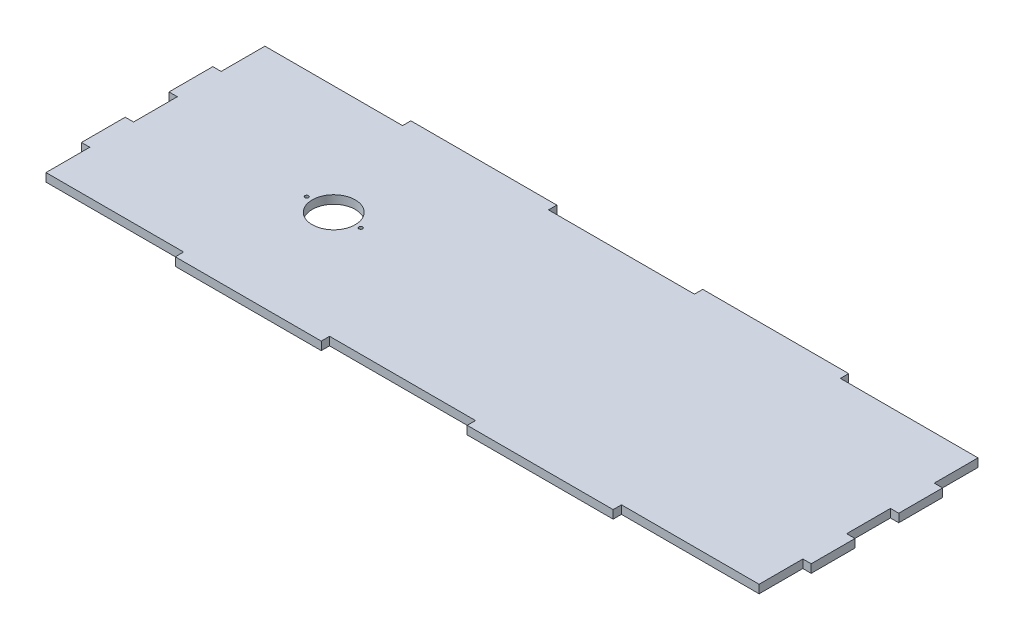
ISO-10303-21;
HEADER;
FILE_DESCRIPTION(('STEP AP214'),'2;1');
FILE_NAME('part.step','',(''),(''),'','','');
FILE_SCHEMA(('AUTOMOTIVE_DESIGN { 1 0 10303 214 1 1 1 1 }'));
ENDSEC;
DATA;
#1=APPLICATION_CONTEXT('core data for automotive mechanical design processes');
#2=APPLICATION_PROTOCOL_DEFINITION('international standard','automotive_design',2000,#1);
#3=PRODUCT_CONTEXT('',#1,'mechanical');
#4=PRODUCT('Part','Part','',(#3));
#5=PRODUCT_RELATED_PRODUCT_CATEGORY('part','',(#4));
#6=PRODUCT_DEFINITION_FORMATION('','',#4);
#7=PRODUCT_DEFINITION_CONTEXT('part definition',#1,'design');
#8=PRODUCT_DEFINITION('design','',#6,#7);
#9=PRODUCT_DEFINITION_SHAPE('','',#8);
#10=(LENGTH_UNIT() NAMED_UNIT(*) SI_UNIT(.MILLI.,.METRE.));
#11=(NAMED_UNIT(*) PLANE_ANGLE_UNIT() SI_UNIT($,.RADIAN.));
#12=(NAMED_UNIT(*) SI_UNIT($,.STERADIAN.) SOLID_ANGLE_UNIT());
#13=UNCERTAINTY_MEASURE_WITH_UNIT(LENGTH_MEASURE(1.E-05),#10,'distance_accuracy_value','');
#14=(GEOMETRIC_REPRESENTATION_CONTEXT(3) GLOBAL_UNCERTAINTY_ASSIGNED_CONTEXT((#13)) GLOBAL_UNIT_ASSIGNED_CONTEXT((#10,
#11,#12)) REPRESENTATION_CONTEXT('',''));
#15=CARTESIAN_POINT('',(0.,0.,0.));
#16=DIRECTION('',(0.,0.,1.));
#17=DIRECTION('',(1.,0.,0.));
#18=AXIS2_PLACEMENT_3D('',#15,#16,#17);
#19=CARTESIAN_POINT('',(0.,2.28,-18.));
#20=DIRECTION('',(0.,0.,1.));
#21=DIRECTION('',(1.,0.,0.));
#22=AXIS2_PLACEMENT_3D('',#19,#20,#21);
#23=PLANE('',#22);
#24=DIRECTION('',(-1.,0.,0.));
#25=VECTOR('',#24,1.);
#26=CARTESIAN_POINT('',(0.,0.,-18.));
#27=LINE('',#26,#25);
#28=CARTESIAN_POINT('',(-97.72,0.,-18.));
#29=VERTEX_POINT('',#28);
#30=CARTESIAN_POINT('',(-100.,0.,-18.));
#31=VERTEX_POINT('',#30);
#32=EDGE_CURVE('E304',#29,#31,#27,.T.);
#33=ORIENTED_EDGE('',*,*,#32,.T.);
#34=DIRECTION('',(0.,-1.,0.));
#35=VECTOR('',#34,1.);
#36=CARTESIAN_POINT('',(-100.,2.28,-18.));
#37=LINE('',#36,#35);
#38=CARTESIAN_POINT('',(-100.,2.28,-18.));
#39=VERTEX_POINT('',#38);
#40=EDGE_CURVE('E11',#39,#31,#37,.T.);
#41=ORIENTED_EDGE('',*,*,#40,.F.);
#42=DIRECTION('',(-1.,0.,0.));
#43=VECTOR('',#42,1.);
#44=CARTESIAN_POINT('',(0.,2.28,-18.));
#45=LINE('',#44,#43);
#46=CARTESIAN_POINT('',(-97.72,2.28,-18.));
#47=VERTEX_POINT('',#46);
#48=EDGE_CURVE('E394',#47,#39,#45,.T.);
#49=ORIENTED_EDGE('',*,*,#48,.F.);
#50=DIRECTION('',(0.,-1.,0.));
#51=VECTOR('',#50,1.);
#52=CARTESIAN_POINT('',(-97.72,2.28,-18.));
#53=LINE('',#52,#51);
#54=EDGE_CURVE('E300',#47,#29,#53,.T.);
#55=ORIENTED_EDGE('',*,*,#54,.T.);
#56=EDGE_LOOP('',(#33,#41,#49,#55));
#57=FACE_BOUND('',#56,.T.);
#58=ADVANCED_FACE('F39',(#57),#23,.F.);
#59=CARTESIAN_POINT('',(-100.,2.28,0.));
#60=DIRECTION('',(1.,0.,0.));
#61=DIRECTION('',(0.,0.,-1.));
#62=AXIS2_PLACEMENT_3D('',#59,#60,#61);
#63=PLANE('',#62);
#64=DIRECTION('',(0.,0.,1.));
#65=VECTOR('',#64,1.);
#66=CARTESIAN_POINT('',(-100.,0.,0.));
#67=LINE('',#66,#65);
#68=CARTESIAN_POINT('',(-100.,0.,-5.99999999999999));
#69=VERTEX_POINT('',#68);
#70=EDGE_CURVE('E307',#31,#69,#67,.T.);
#71=ORIENTED_EDGE('',*,*,#70,.T.);
#72=DIRECTION('',(0.,-1.,0.));
#73=VECTOR('',#72,1.);
#74=CARTESIAN_POINT('',(-100.,2.28,-5.99999999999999));
#75=LINE('',#74,#73);
#76=CARTESIAN_POINT('',(-100.,2.28,-5.99999999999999));
#77=VERTEX_POINT('',#76);
#78=EDGE_CURVE('E48',#77,#69,#75,.T.);
#79=ORIENTED_EDGE('',*,*,#78,.F.);
#80=DIRECTION('',(0.,0.,1.));
#81=VECTOR('',#80,1.);
#82=CARTESIAN_POINT('',(-100.,2.28,0.));
#83=LINE('',#82,#81);
#84=EDGE_CURVE('E180',#39,#77,#83,.T.);
#85=ORIENTED_EDGE('',*,*,#84,.F.);
#86=ORIENTED_EDGE('',*,*,#40,.T.);
#87=EDGE_LOOP('',(#71,#79,#85,#86));
#88=FACE_BOUND('',#87,.T.);
#89=ADVANCED_FACE('F498',(#88),#63,.F.);
#90=CARTESIAN_POINT('',(0.,2.28,-5.99999999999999));
#91=DIRECTION('',(0.,0.,-1.));
#92=DIRECTION('',(-1.,0.,0.));
#93=AXIS2_PLACEMENT_3D('',#90,#91,#92);
#94=PLANE('',#93);
#95=DIRECTION('',(1.,0.,0.));
#96=VECTOR('',#95,1.);
#97=CARTESIAN_POINT('',(0.,0.,-5.99999999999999));
#98=LINE('',#97,#96);
#99=CARTESIAN_POINT('',(-97.72,0.,-5.99999999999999));
#100=VERTEX_POINT('',#99);
#101=EDGE_CURVE('E309',#69,#100,#98,.T.);
#102=ORIENTED_EDGE('',*,*,#101,.T.);
#103=DIRECTION('',(0.,-1.,0.));
#104=VECTOR('',#103,1.);
#105=CARTESIAN_POINT('',(-97.72,2.28,-5.99999999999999));
#106=LINE('',#105,#104);
#107=CARTESIAN_POINT('',(-97.72,2.28,-5.99999999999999));
#108=VERTEX_POINT('',#107);
#109=EDGE_CURVE('E467',#108,#100,#106,.T.);
#110=ORIENTED_EDGE('',*,*,#109,.F.);
#111=DIRECTION('',(1.,0.,0.));
#112=VECTOR('',#111,1.);
#113=CARTESIAN_POINT('',(0.,2.28,-5.99999999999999));
#114=LINE('',#113,#112);
#115=EDGE_CURVE('E513',#77,#108,#114,.T.);
#116=ORIENTED_EDGE('',*,*,#115,.F.);
#117=ORIENTED_EDGE('',*,*,#78,.T.);
#118=EDGE_LOOP('',(#102,#110,#116,#117));
#119=FACE_BOUND('',#118,.T.);
#120=ADVANCED_FACE('F503',(#119),#94,.F.);
#121=CARTESIAN_POINT('',(-97.72,2.28,0.));
#122=DIRECTION('',(1.,0.,0.));
#123=DIRECTION('',(0.,0.,-1.));
#124=AXIS2_PLACEMENT_3D('',#121,#122,#123);
#125=PLANE('',#124);
#126=DIRECTION('',(0.,0.,1.));
#127=VECTOR('',#126,1.);
#128=CARTESIAN_POINT('',(-97.72,0.,0.));
#129=LINE('',#128,#127);
#130=CARTESIAN_POINT('',(-97.72,0.,6.00000000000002));
#131=VERTEX_POINT('',#130);
#132=EDGE_CURVE('E311',#100,#131,#129,.T.);
#133=ORIENTED_EDGE('',*,*,#132,.T.);
#134=DIRECTION('',(0.,-1.,0.));
#135=VECTOR('',#134,1.);
#136=CARTESIAN_POINT('',(-97.72,2.28,6.00000000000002));
#137=LINE('',#136,#135);
#138=CARTESIAN_POINT('',(-97.72,2.28,6.00000000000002));
#139=VERTEX_POINT('',#138);
#140=EDGE_CURVE('E464',#139,#131,#137,.T.);
#141=ORIENTED_EDGE('',*,*,#140,.F.);
#142=DIRECTION('',(0.,0.,1.));
#143=VECTOR('',#142,1.);
#144=CARTESIAN_POINT('',(-97.72,2.28,0.));
#145=LINE('',#144,#143);
#146=EDGE_CURVE('E515',#108,#139,#145,.T.);
#147=ORIENTED_EDGE('',*,*,#146,.F.);
#148=ORIENTED_EDGE('',*,*,#109,.T.);
#149=EDGE_LOOP('',(#133,#141,#147,#148));
#150=FACE_BOUND('',#149,.T.);
#151=ADVANCED_FACE('F719',(#150),#125,.F.);
#152=CARTESIAN_POINT('',(0.,2.28,6.00000000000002));
#153=DIRECTION('',(0.,0.,1.));
#154=DIRECTION('',(1.,0.,0.));
#155=AXIS2_PLACEMENT_3D('',#152,#153,#154);
#156=PLANE('',#155);
#157=DIRECTION('',(-1.,0.,0.));
#158=VECTOR('',#157,1.);
#159=CARTESIAN_POINT('',(0.,0.,6.00000000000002));
#160=LINE('',#159,#158);
#161=CARTESIAN_POINT('',(-100.,0.,6.00000000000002));
#162=VERTEX_POINT('',#161);
#163=EDGE_CURVE('E313',#131,#162,#160,.T.);
#164=ORIENTED_EDGE('',*,*,#163,.T.);
#165=DIRECTION('',(0.,-1.,0.));
#166=VECTOR('',#165,1.);
#167=CARTESIAN_POINT('',(-100.,2.28,6.00000000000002));
#168=LINE('',#167,#166);
#169=CARTESIAN_POINT('',(-100.,2.28,6.00000000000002));
#170=VERTEX_POINT('',#169);
#171=EDGE_CURVE('E461',#170,#162,#168,.T.);
#172=ORIENTED_EDGE('',*,*,#171,.F.);
#173=DIRECTION('',(-1.,0.,0.));
#174=VECTOR('',#173,1.);
#175=CARTESIAN_POINT('',(0.,2.28,6.00000000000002));
#176=LINE('',#175,#174);
#177=EDGE_CURVE('E517',#139,#170,#176,.T.);
#178=ORIENTED_EDGE('',*,*,#177,.F.);
#179=ORIENTED_EDGE('',*,*,#140,.T.);
#180=EDGE_LOOP('',(#164,#172,#178,#179));
#181=FACE_BOUND('',#180,.T.);
#182=ADVANCED_FACE('F715',(#181),#156,.F.);
#183=CARTESIAN_POINT('',(-100.,2.28,0.));
#184=DIRECTION('',(1.,0.,0.));
#185=DIRECTION('',(0.,0.,-1.));
#186=AXIS2_PLACEMENT_3D('',#183,#184,#185);
#187=PLANE('',#186);
#188=DIRECTION('',(0.,0.,1.));
#189=VECTOR('',#188,1.);
#190=CARTESIAN_POINT('',(-100.,0.,0.));
#191=LINE('',#190,#189);
#192=CARTESIAN_POINT('',(-100.,0.,18.));
#193=VERTEX_POINT('',#192);
#194=EDGE_CURVE('E315',#162,#193,#191,.T.);
#195=ORIENTED_EDGE('',*,*,#194,.T.);
#196=DIRECTION('',(0.,-1.,0.));
#197=VECTOR('',#196,1.);
#198=CARTESIAN_POINT('',(-100.,2.28,18.));
#199=LINE('',#198,#197);
#200=CARTESIAN_POINT('',(-100.,2.28,18.));
#201=VERTEX_POINT('',#200);
#202=EDGE_CURVE('E458',#201,#193,#199,.T.);
#203=ORIENTED_EDGE('',*,*,#202,.F.);
#204=DIRECTION('',(0.,0.,1.));
#205=VECTOR('',#204,1.);
#206=CARTESIAN_POINT('',(-100.,2.28,0.));
#207=LINE('',#206,#205);
#208=EDGE_CURVE('E523',#170,#201,#207,.T.);
#209=ORIENTED_EDGE('',*,*,#208,.F.);
#210=ORIENTED_EDGE('',*,*,#171,.T.);
#211=EDGE_LOOP('',(#195,#203,#209,#210));
#212=FACE_BOUND('',#211,.T.);
#213=ADVANCED_FACE('F711',(#212),#187,.F.);
#214=CARTESIAN_POINT('',(0.,2.28,18.));
#215=DIRECTION('',(0.,0.,-1.));
#216=DIRECTION('',(-1.,0.,0.));
#217=AXIS2_PLACEMENT_3D('',#214,#215,#216);
#218=PLANE('',#217);
#219=DIRECTION('',(1.,0.,0.));
#220=VECTOR('',#219,1.);
#221=CARTESIAN_POINT('',(0.,0.,18.));
#222=LINE('',#221,#220);
#223=CARTESIAN_POINT('',(-97.72,0.,18.));
#224=VERTEX_POINT('',#223);
#225=EDGE_CURVE('E317',#193,#224,#222,.T.);
#226=ORIENTED_EDGE('',*,*,#225,.T.);
#227=DIRECTION('',(0.,-1.,0.));
#228=VECTOR('',#227,1.);
#229=CARTESIAN_POINT('',(-97.72,2.28,18.));
#230=LINE('',#229,#228);
#231=CARTESIAN_POINT('',(-97.72,2.28,18.));
#232=VERTEX_POINT('',#231);
#233=EDGE_CURVE('E455',#232,#224,#230,.T.);
#234=ORIENTED_EDGE('',*,*,#233,.F.);
#235=DIRECTION('',(1.,0.,0.));
#236=VECTOR('',#235,1.);
#237=CARTESIAN_POINT('',(0.,2.28,18.));
#238=LINE('',#237,#236);
#239=EDGE_CURVE('E525',#201,#232,#238,.T.);
#240=ORIENTED_EDGE('',*,*,#239,.F.);
#241=ORIENTED_EDGE('',*,*,#202,.T.);
#242=EDGE_LOOP('',(#226,#234,#240,#241));
#243=FACE_BOUND('',#242,.T.);
#244=ADVANCED_FACE('F707',(#243),#218,.F.);
#245=CARTESIAN_POINT('',(-97.72,2.28,0.));
#246=DIRECTION('',(1.,0.,0.));
#247=DIRECTION('',(0.,0.,-1.));
#248=AXIS2_PLACEMENT_3D('',#245,#246,#247);
#249=PLANE('',#248);
#250=DIRECTION('',(0.,0.,1.));
#251=VECTOR('',#250,1.);
#252=CARTESIAN_POINT('',(-97.72,0.,0.));
#253=LINE('',#252,#251);
#254=CARTESIAN_POINT('',(-97.72,0.,30.));
#255=VERTEX_POINT('',#254);
#256=EDGE_CURVE('E319',#224,#255,#253,.T.);
#257=ORIENTED_EDGE('',*,*,#256,.T.);
#258=DIRECTION('',(0.,-1.,0.));
#259=VECTOR('',#258,1.);
#260=CARTESIAN_POINT('',(-97.72,2.28,30.));
#261=LINE('',#260,#259);
#262=CARTESIAN_POINT('',(-97.72,2.28,30.));
#263=VERTEX_POINT('',#262);
#264=EDGE_CURVE('E452',#263,#255,#261,.T.);
#265=ORIENTED_EDGE('',*,*,#264,.F.);
#266=DIRECTION('',(0.,0.,1.));
#267=VECTOR('',#266,1.);
#268=CARTESIAN_POINT('',(-97.72,2.28,0.));
#269=LINE('',#268,#267);
#270=EDGE_CURVE('E527',#232,#263,#269,.T.);
#271=ORIENTED_EDGE('',*,*,#270,.F.);
#272=ORIENTED_EDGE('',*,*,#233,.T.);
#273=EDGE_LOOP('',(#257,#265,#271,#272));
#274=FACE_BOUND('',#273,.T.);
#275=ADVANCED_FACE('F702',(#274),#249,.F.);
#276=CARTESIAN_POINT('',(0.,2.28,30.));
#277=DIRECTION('',(0.,0.,-1.));
#278=DIRECTION('',(-1.,0.,0.));
#279=AXIS2_PLACEMENT_3D('',#276,#277,#278);
#280=PLANE('',#279);
#281=DIRECTION('',(1.,0.,0.));
#282=VECTOR('',#281,1.);
#283=CARTESIAN_POINT('',(0.,0.,30.));
#284=LINE('',#283,#282);
#285=CARTESIAN_POINT('',(-60.,0.,30.));
#286=VERTEX_POINT('',#285);
#287=EDGE_CURVE('E321',#255,#286,#284,.T.);
#288=ORIENTED_EDGE('',*,*,#287,.T.);
#289=DIRECTION('',(0.,-1.,0.));
#290=VECTOR('',#289,1.);
#291=CARTESIAN_POINT('',(-60.,2.28,30.));
#292=LINE('',#291,#290);
#293=CARTESIAN_POINT('',(-60.,2.28,30.));
#294=VERTEX_POINT('',#293);
#295=EDGE_CURVE('E449',#294,#286,#292,.T.);
#296=ORIENTED_EDGE('',*,*,#295,.F.);
#297=DIRECTION('',(1.,0.,0.));
#298=VECTOR('',#297,1.);
#299=CARTESIAN_POINT('',(0.,2.28,30.));
#300=LINE('',#299,#298);
#301=EDGE_CURVE('E529',#263,#294,#300,.T.);
#302=ORIENTED_EDGE('',*,*,#301,.F.);
#303=ORIENTED_EDGE('',*,*,#264,.T.);
#304=EDGE_LOOP('',(#288,#296,#302,#303));
#305=FACE_BOUND('',#304,.T.);
#306=ADVANCED_FACE('F696',(#305),#280,.F.);
#307=CARTESIAN_POINT('',(-60.,2.28,0.));
#308=DIRECTION('',(1.,0.,0.));
#309=DIRECTION('',(0.,0.,-1.));
#310=AXIS2_PLACEMENT_3D('',#307,#308,#309);
#311=PLANE('',#310);
#312=DIRECTION('',(0.,0.,1.));
#313=VECTOR('',#312,1.);
#314=CARTESIAN_POINT('',(-60.,0.,0.));
#315=LINE('',#314,#313);
#316=CARTESIAN_POINT('',(-60.,0.,32.28));
#317=VERTEX_POINT('',#316);
#318=EDGE_CURVE('E323',#286,#317,#315,.T.);
#319=ORIENTED_EDGE('',*,*,#318,.T.);
#320=DIRECTION('',(0.,-1.,0.));
#321=VECTOR('',#320,1.);
#322=CARTESIAN_POINT('',(-60.,2.28,32.28));
#323=LINE('',#322,#321);
#324=CARTESIAN_POINT('',(-60.,2.28,32.28));
#325=VERTEX_POINT('',#324);
#326=EDGE_CURVE('E446',#325,#317,#323,.T.);
#327=ORIENTED_EDGE('',*,*,#326,.F.);
#328=DIRECTION('',(0.,0.,1.));
#329=VECTOR('',#328,1.);
#330=CARTESIAN_POINT('',(-60.,2.28,0.));
#331=LINE('',#330,#329);
#332=EDGE_CURVE('E531',#294,#325,#331,.T.);
#333=ORIENTED_EDGE('',*,*,#332,.F.);
#334=ORIENTED_EDGE('',*,*,#295,.T.);
#335=EDGE_LOOP('',(#319,#327,#333,#334));
#336=FACE_BOUND('',#335,.T.);
#337=ADVANCED_FACE('F692',(#336),#311,.F.);
#338=CARTESIAN_POINT('',(0.,2.28,32.28));
#339=DIRECTION('',(0.,0.,-1.));
#340=DIRECTION('',(-1.,0.,0.));
#341=AXIS2_PLACEMENT_3D('',#338,#339,#340);
#342=PLANE('',#341);
#343=DIRECTION('',(1.,0.,0.));
#344=VECTOR('',#343,1.);
#345=CARTESIAN_POINT('',(0.,0.,32.28));
#346=LINE('',#345,#344);
#347=CARTESIAN_POINT('',(-20.,0.,32.28));
#348=VERTEX_POINT('',#347);
#349=EDGE_CURVE('E325',#317,#348,#346,.T.);
#350=ORIENTED_EDGE('',*,*,#349,.T.);
#351=DIRECTION('',(0.,-1.,0.));
#352=VECTOR('',#351,1.);
#353=CARTESIAN_POINT('',(-20.,2.28,32.28));
#354=LINE('',#353,#352);
#355=CARTESIAN_POINT('',(-20.,2.28,32.28));
#356=VERTEX_POINT('',#355);
#357=EDGE_CURVE('E443',#356,#348,#354,.T.);
#358=ORIENTED_EDGE('',*,*,#357,.F.);
#359=DIRECTION('',(1.,0.,0.));
#360=VECTOR('',#359,1.);
#361=CARTESIAN_POINT('',(0.,2.28,32.28));
#362=LINE('',#361,#360);
#363=EDGE_CURVE('E533',#325,#356,#362,.T.);
#364=ORIENTED_EDGE('',*,*,#363,.F.);
#365=ORIENTED_EDGE('',*,*,#326,.T.);
#366=EDGE_LOOP('',(#350,#358,#364,#365));
#367=FACE_BOUND('',#366,.T.);
#368=ADVANCED_FACE('F687',(#367),#342,.F.);
#369=CARTESIAN_POINT('',(-20.,2.28,0.));
#370=DIRECTION('',(-1.,0.,0.));
#371=DIRECTION('',(0.,0.,1.));
#372=AXIS2_PLACEMENT_3D('',#369,#370,#371);
#373=PLANE('',#372);
#374=DIRECTION('',(0.,0.,-1.));
#375=VECTOR('',#374,1.);
#376=CARTESIAN_POINT('',(-20.,0.,0.));
#377=LINE('',#376,#375);
#378=CARTESIAN_POINT('',(-20.,0.,30.));
#379=VERTEX_POINT('',#378);
#380=EDGE_CURVE('E327',#348,#379,#377,.T.);
#381=ORIENTED_EDGE('',*,*,#380,.T.);
#382=DIRECTION('',(0.,-1.,0.));
#383=VECTOR('',#382,1.);
#384=CARTESIAN_POINT('',(-20.,2.28,30.));
#385=LINE('',#384,#383);
#386=CARTESIAN_POINT('',(-20.,2.28,30.));
#387=VERTEX_POINT('',#386);
#388=EDGE_CURVE('E441',#387,#379,#385,.T.);
#389=ORIENTED_EDGE('',*,*,#388,.F.);
#390=DIRECTION('',(0.,0.,-1.));
#391=VECTOR('',#390,1.);
#392=CARTESIAN_POINT('',(-20.,2.28,0.));
#393=LINE('',#392,#391);
#394=EDGE_CURVE('E535',#356,#387,#393,.T.);
#395=ORIENTED_EDGE('',*,*,#394,.F.);
#396=ORIENTED_EDGE('',*,*,#357,.T.);
#397=EDGE_LOOP('',(#381,#389,#395,#396));
#398=FACE_BOUND('',#397,.T.);
#399=ADVANCED_FACE('F681',(#398),#373,.F.);
#400=CARTESIAN_POINT('',(0.,2.28,30.));
#401=DIRECTION('',(0.,0.,1.));
#402=DIRECTION('',(1.,0.,0.));
#403=AXIS2_PLACEMENT_3D('',#400,#401,#402);
#404=PLANE('',#403);
#405=DIRECTION('',(-1.,0.,0.));
#406=VECTOR('',#405,1.);
#407=CARTESIAN_POINT('',(0.,0.,30.));
#408=LINE('',#407,#406);
#409=CARTESIAN_POINT('',(20.,0.,30.));
#410=VERTEX_POINT('',#409);
#411=EDGE_CURVE('E330',#410,#379,#408,.T.);
#412=ORIENTED_EDGE('',*,*,#411,.F.);
#413=DIRECTION('',(0.,-1.,0.));
#414=VECTOR('',#413,1.);
#415=CARTESIAN_POINT('',(20.,2.28,30.));
#416=LINE('',#415,#414);
#417=CARTESIAN_POINT('',(20.,2.28,30.));
#418=VERTEX_POINT('',#417);
#419=EDGE_CURVE('E439',#418,#410,#416,.T.);
#420=ORIENTED_EDGE('',*,*,#419,.F.);
#421=DIRECTION('',(-1.,0.,0.));
#422=VECTOR('',#421,1.);
#423=CARTESIAN_POINT('',(0.,2.28,30.));
#424=LINE('',#423,#422);
#425=EDGE_CURVE('E537',#418,#387,#424,.T.);
#426=ORIENTED_EDGE('',*,*,#425,.T.);
#427=ORIENTED_EDGE('',*,*,#388,.T.);
#428=EDGE_LOOP('',(#412,#420,#426,#427));
#429=FACE_BOUND('',#428,.T.);
#430=ADVANCED_FACE('F675',(#429),#404,.T.);
#431=CARTESIAN_POINT('',(20.,2.28,0.));
#432=DIRECTION('',(1.,0.,0.));
#433=DIRECTION('',(0.,0.,-1.));
#434=AXIS2_PLACEMENT_3D('',#431,#432,#433);
#435=PLANE('',#434);
#436=DIRECTION('',(0.,0.,1.));
#437=VECTOR('',#436,1.);
#438=CARTESIAN_POINT('',(20.,0.,0.));
#439=LINE('',#438,#437);
#440=CARTESIAN_POINT('',(20.,0.,32.28));
#441=VERTEX_POINT('',#440);
#442=EDGE_CURVE('E333',#410,#441,#439,.T.);
#443=ORIENTED_EDGE('',*,*,#442,.T.);
#444=DIRECTION('',(0.,-1.,0.));
#445=VECTOR('',#444,1.);
#446=CARTESIAN_POINT('',(20.,2.28,32.28));
#447=LINE('',#446,#445);
#448=CARTESIAN_POINT('',(20.,2.28,32.28));
#449=VERTEX_POINT('',#448);
#450=EDGE_CURVE('E436',#449,#441,#447,.T.);
#451=ORIENTED_EDGE('',*,*,#450,.F.);
#452=DIRECTION('',(0.,0.,1.));
#453=VECTOR('',#452,1.);
#454=CARTESIAN_POINT('',(20.,2.28,0.));
#455=LINE('',#454,#453);
#456=EDGE_CURVE('E540',#418,#449,#455,.T.);
#457=ORIENTED_EDGE('',*,*,#456,.F.);
#458=ORIENTED_EDGE('',*,*,#419,.T.);
#459=EDGE_LOOP('',(#443,#451,#457,#458));
#460=FACE_BOUND('',#459,.T.);
#461=ADVANCED_FACE('F720',(#460),#435,.F.);
#462=CARTESIAN_POINT('',(0.,2.28,32.28));
#463=DIRECTION('',(0.,0.,-1.));
#464=DIRECTION('',(-1.,0.,0.));
#465=AXIS2_PLACEMENT_3D('',#462,#463,#464);
#466=PLANE('',#465);
#467=DIRECTION('',(1.,0.,0.));
#468=VECTOR('',#467,1.);
#469=CARTESIAN_POINT('',(0.,0.,32.28));
#470=LINE('',#469,#468);
#471=CARTESIAN_POINT('',(60.,0.,32.28));
#472=VERTEX_POINT('',#471);
#473=EDGE_CURVE('E335',#441,#472,#470,.T.);
#474=ORIENTED_EDGE('',*,*,#473,.T.);
#475=DIRECTION('',(0.,-1.,0.));
#476=VECTOR('',#475,1.);
#477=CARTESIAN_POINT('',(60.,2.28,32.28));
#478=LINE('',#477,#476);
#479=CARTESIAN_POINT('',(60.,2.28,32.28));
#480=VERTEX_POINT('',#479);
#481=EDGE_CURVE('E433',#480,#472,#478,.T.);
#482=ORIENTED_EDGE('',*,*,#481,.F.);
#483=DIRECTION('',(1.,0.,0.));
#484=VECTOR('',#483,1.);
#485=CARTESIAN_POINT('',(0.,2.28,32.28));
#486=LINE('',#485,#484);
#487=EDGE_CURVE('E542',#449,#480,#486,.T.);
#488=ORIENTED_EDGE('',*,*,#487,.F.);
#489=ORIENTED_EDGE('',*,*,#450,.T.);
#490=EDGE_LOOP('',(#474,#482,#488,#489));
#491=FACE_BOUND('',#490,.T.);
#492=ADVANCED_FACE('F668',(#491),#466,.F.);
#493=CARTESIAN_POINT('',(60.,2.28,0.));
#494=DIRECTION('',(-1.,0.,0.));
#495=DIRECTION('',(0.,0.,1.));
#496=AXIS2_PLACEMENT_3D('',#493,#494,#495);
#497=PLANE('',#496);
#498=DIRECTION('',(0.,0.,-1.));
#499=VECTOR('',#498,1.);
#500=CARTESIAN_POINT('',(60.,0.,0.));
#501=LINE('',#500,#499);
#502=CARTESIAN_POINT('',(60.,0.,30.));
#503=VERTEX_POINT('',#502);
#504=EDGE_CURVE('E337',#472,#503,#501,.T.);
#505=ORIENTED_EDGE('',*,*,#504,.T.);
#506=DIRECTION('',(0.,-1.,0.));
#507=VECTOR('',#506,1.);
#508=CARTESIAN_POINT('',(60.,2.28,30.));
#509=LINE('',#508,#507);
#510=CARTESIAN_POINT('',(60.,2.28,30.));
#511=VERTEX_POINT('',#510);
#512=EDGE_CURVE('E430',#511,#503,#509,.T.);
#513=ORIENTED_EDGE('',*,*,#512,.F.);
#514=DIRECTION('',(0.,0.,-1.));
#515=VECTOR('',#514,1.);
#516=CARTESIAN_POINT('',(60.,2.28,0.));
#517=LINE('',#516,#515);
#518=EDGE_CURVE('E544',#480,#511,#517,.T.);
#519=ORIENTED_EDGE('',*,*,#518,.F.);
#520=ORIENTED_EDGE('',*,*,#481,.T.);
#521=EDGE_LOOP('',(#505,#513,#519,#520));
#522=FACE_BOUND('',#521,.T.);
#523=ADVANCED_FACE('F664',(#522),#497,.F.);
#524=CARTESIAN_POINT('',(0.,2.28,30.));
#525=DIRECTION('',(0.,0.,-1.));
#526=DIRECTION('',(-1.,0.,0.));
#527=AXIS2_PLACEMENT_3D('',#524,#525,#526);
#528=PLANE('',#527);
#529=DIRECTION('',(1.,0.,0.));
#530=VECTOR('',#529,1.);
#531=CARTESIAN_POINT('',(0.,0.,30.));
#532=LINE('',#531,#530);
#533=CARTESIAN_POINT('',(97.72,0.,30.));
#534=VERTEX_POINT('',#533);
#535=EDGE_CURVE('E339',#503,#534,#532,.T.);
#536=ORIENTED_EDGE('',*,*,#535,.T.);
#537=DIRECTION('',(0.,-1.,0.));
#538=VECTOR('',#537,1.);
#539=CARTESIAN_POINT('',(97.72,2.28,30.));
#540=LINE('',#539,#538);
#541=CARTESIAN_POINT('',(97.72,2.28,30.));
#542=VERTEX_POINT('',#541);
#543=EDGE_CURVE('E428',#542,#534,#540,.T.);
#544=ORIENTED_EDGE('',*,*,#543,.F.);
#545=DIRECTION('',(1.,0.,0.));
#546=VECTOR('',#545,1.);
#547=CARTESIAN_POINT('',(0.,2.28,30.));
#548=LINE('',#547,#546);
#549=EDGE_CURVE('E546',#511,#542,#548,.T.);
#550=ORIENTED_EDGE('',*,*,#549,.F.);
#551=ORIENTED_EDGE('',*,*,#512,.T.);
#552=EDGE_LOOP('',(#536,#544,#550,#551));
#553=FACE_BOUND('',#552,.T.);
#554=ADVANCED_FACE('F659',(#553),#528,.F.);
#555=CARTESIAN_POINT('',(97.72,2.28,0.));
#556=DIRECTION('',(1.,0.,0.));
#557=DIRECTION('',(0.,0.,-1.));
#558=AXIS2_PLACEMENT_3D('',#555,#556,#557);
#559=PLANE('',#558);
#560=DIRECTION('',(0.,0.,1.));
#561=VECTOR('',#560,1.);
#562=CARTESIAN_POINT('',(97.72,0.,0.));
#563=LINE('',#562,#561);
#564=CARTESIAN_POINT('',(97.72,0.,18.));
#565=VERTEX_POINT('',#564);
#566=EDGE_CURVE('E342',#565,#534,#563,.T.);
#567=ORIENTED_EDGE('',*,*,#566,.F.);
#568=DIRECTION('',(0.,-1.,0.));
#569=VECTOR('',#568,1.);
#570=CARTESIAN_POINT('',(97.72,2.28,18.));
#571=LINE('',#570,#569);
#572=CARTESIAN_POINT('',(97.72,2.28,18.));
#573=VERTEX_POINT('',#572);
#574=EDGE_CURVE('E426',#573,#565,#571,.T.);
#575=ORIENTED_EDGE('',*,*,#574,.F.);
#576=DIRECTION('',(0.,0.,1.));
#577=VECTOR('',#576,1.);
#578=CARTESIAN_POINT('',(97.72,2.28,0.));
#579=LINE('',#578,#577);
#580=EDGE_CURVE('E548',#573,#542,#579,.T.);
#581=ORIENTED_EDGE('',*,*,#580,.T.);
#582=ORIENTED_EDGE('',*,*,#543,.T.);
#583=EDGE_LOOP('',(#567,#575,#581,#582));
#584=FACE_BOUND('',#583,.T.);
#585=ADVANCED_FACE('F653',(#584),#559,.T.);
#586=CARTESIAN_POINT('',(0.,2.28,18.));
#587=DIRECTION('',(0.,0.,1.));
#588=DIRECTION('',(1.,0.,0.));
#589=AXIS2_PLACEMENT_3D('',#586,#587,#588);
#590=PLANE('',#589);
#591=DIRECTION('',(-1.,0.,0.));
#592=VECTOR('',#591,1.);
#593=CARTESIAN_POINT('',(0.,0.,18.));
#594=LINE('',#593,#592);
#595=CARTESIAN_POINT('',(100.,0.,18.));
#596=VERTEX_POINT('',#595);
#597=EDGE_CURVE('E345',#596,#565,#594,.T.);
#598=ORIENTED_EDGE('',*,*,#597,.F.);
#599=DIRECTION('',(0.,-1.,0.));
#600=VECTOR('',#599,1.);
#601=CARTESIAN_POINT('',(100.,2.28,18.));
#602=LINE('',#601,#600);
#603=CARTESIAN_POINT('',(100.,2.28,18.));
#604=VERTEX_POINT('',#603);
#605=EDGE_CURVE('E424',#604,#596,#602,.T.);
#606=ORIENTED_EDGE('',*,*,#605,.F.);
#607=DIRECTION('',(-1.,0.,0.));
#608=VECTOR('',#607,1.);
#609=CARTESIAN_POINT('',(0.,2.28,18.));
#610=LINE('',#609,#608);
#611=EDGE_CURVE('E551',#604,#573,#610,.T.);
#612=ORIENTED_EDGE('',*,*,#611,.T.);
#613=ORIENTED_EDGE('',*,*,#574,.T.);
#614=EDGE_LOOP('',(#598,#606,#612,#613));
#615=FACE_BOUND('',#614,.T.);
#616=ADVANCED_FACE('F649',(#615),#590,.T.);
#617=CARTESIAN_POINT('',(100.,2.28,0.));
#618=DIRECTION('',(1.,0.,0.));
#619=DIRECTION('',(0.,0.,-1.));
#620=AXIS2_PLACEMENT_3D('',#617,#618,#619);
#621=PLANE('',#620);
#622=DIRECTION('',(0.,0.,1.));
#623=VECTOR('',#622,1.);
#624=CARTESIAN_POINT('',(100.,0.,0.));
#625=LINE('',#624,#623);
#626=CARTESIAN_POINT('',(100.,0.,6.00000000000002));
#627=VERTEX_POINT('',#626);
#628=EDGE_CURVE('E348',#627,#596,#625,.T.);
#629=ORIENTED_EDGE('',*,*,#628,.F.);
#630=DIRECTION('',(0.,-1.,0.));
#631=VECTOR('',#630,1.);
#632=CARTESIAN_POINT('',(100.,2.28,6.00000000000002));
#633=LINE('',#632,#631);
#634=CARTESIAN_POINT('',(100.,2.28,6.00000000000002));
#635=VERTEX_POINT('',#634);
#636=EDGE_CURVE('E422',#635,#627,#633,.T.);
#637=ORIENTED_EDGE('',*,*,#636,.F.);
#638=DIRECTION('',(0.,0.,1.));
#639=VECTOR('',#638,1.);
#640=CARTESIAN_POINT('',(100.,2.28,0.));
#641=LINE('',#640,#639);
#642=EDGE_CURVE('E554',#635,#604,#641,.T.);
#643=ORIENTED_EDGE('',*,*,#642,.T.);
#644=ORIENTED_EDGE('',*,*,#605,.T.);
#645=EDGE_LOOP('',(#629,#637,#643,#644));
#646=FACE_BOUND('',#645,.T.);
#647=ADVANCED_FACE('F645',(#646),#621,.T.);
#648=CARTESIAN_POINT('',(0.,2.28,6.00000000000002));
#649=DIRECTION('',(0.,0.,-1.));
#650=DIRECTION('',(-1.,0.,0.));
#651=AXIS2_PLACEMENT_3D('',#648,#649,#650);
#652=PLANE('',#651);
#653=DIRECTION('',(1.,0.,0.));
#654=VECTOR('',#653,1.);
#655=CARTESIAN_POINT('',(0.,0.,6.00000000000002));
#656=LINE('',#655,#654);
#657=CARTESIAN_POINT('',(97.72,0.,6.00000000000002));
#658=VERTEX_POINT('',#657);
#659=EDGE_CURVE('E351',#658,#627,#656,.T.);
#660=ORIENTED_EDGE('',*,*,#659,.F.);
#661=DIRECTION('',(0.,-1.,0.));
#662=VECTOR('',#661,1.);
#663=CARTESIAN_POINT('',(97.72,2.28,6.00000000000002));
#664=LINE('',#663,#662);
#665=CARTESIAN_POINT('',(97.72,2.28,6.00000000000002));
#666=VERTEX_POINT('',#665);
#667=EDGE_CURVE('E420',#666,#658,#664,.T.);
#668=ORIENTED_EDGE('',*,*,#667,.F.);
#669=DIRECTION('',(1.,0.,0.));
#670=VECTOR('',#669,1.);
#671=CARTESIAN_POINT('',(0.,2.28,6.00000000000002));
#672=LINE('',#671,#670);
#673=EDGE_CURVE('E557',#666,#635,#672,.T.);
#674=ORIENTED_EDGE('',*,*,#673,.T.);
#675=ORIENTED_EDGE('',*,*,#636,.T.);
#676=EDGE_LOOP('',(#660,#668,#674,#675));
#677=FACE_BOUND('',#676,.T.);
#678=ADVANCED_FACE('F641',(#677),#652,.T.);
#679=CARTESIAN_POINT('',(97.72,2.28,0.));
#680=DIRECTION('',(1.,0.,0.));
#681=DIRECTION('',(0.,0.,-1.));
#682=AXIS2_PLACEMENT_3D('',#679,#680,#681);
#683=PLANE('',#682);
#684=DIRECTION('',(0.,0.,1.));
#685=VECTOR('',#684,1.);
#686=CARTESIAN_POINT('',(97.72,0.,0.));
#687=LINE('',#686,#685);
#688=CARTESIAN_POINT('',(97.72,0.,-5.99999999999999));
#689=VERTEX_POINT('',#688);
#690=EDGE_CURVE('E354',#689,#658,#687,.T.);
#691=ORIENTED_EDGE('',*,*,#690,.F.);
#692=DIRECTION('',(0.,-1.,0.));
#693=VECTOR('',#692,1.);
#694=CARTESIAN_POINT('',(97.72,2.28,-5.99999999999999));
#695=LINE('',#694,#693);
#696=CARTESIAN_POINT('',(97.72,2.28,-5.99999999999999));
#697=VERTEX_POINT('',#696);
#698=EDGE_CURVE('E418',#697,#689,#695,.T.);
#699=ORIENTED_EDGE('',*,*,#698,.F.);
#700=DIRECTION('',(0.,0.,1.));
#701=VECTOR('',#700,1.);
#702=CARTESIAN_POINT('',(97.72,2.28,0.));
#703=LINE('',#702,#701);
#704=EDGE_CURVE('E560',#697,#666,#703,.T.);
#705=ORIENTED_EDGE('',*,*,#704,.T.);
#706=ORIENTED_EDGE('',*,*,#667,.T.);
#707=EDGE_LOOP('',(#691,#699,#705,#706));
#708=FACE_BOUND('',#707,.T.);
#709=ADVANCED_FACE('F637',(#708),#683,.T.);
#710=CARTESIAN_POINT('',(0.,2.28,-5.99999999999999));
#711=DIRECTION('',(0.,0.,1.));
#712=DIRECTION('',(1.,0.,0.));
#713=AXIS2_PLACEMENT_3D('',#710,#711,#712);
#714=PLANE('',#713);
#715=DIRECTION('',(-1.,0.,0.));
#716=VECTOR('',#715,1.);
#717=CARTESIAN_POINT('',(0.,0.,-5.99999999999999));
#718=LINE('',#717,#716);
#719=CARTESIAN_POINT('',(100.,0.,-5.99999999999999));
#720=VERTEX_POINT('',#719);
#721=EDGE_CURVE('E357',#720,#689,#718,.T.);
#722=ORIENTED_EDGE('',*,*,#721,.F.);
#723=DIRECTION('',(0.,-1.,0.));
#724=VECTOR('',#723,1.);
#725=CARTESIAN_POINT('',(100.,2.28,-5.99999999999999));
#726=LINE('',#725,#724);
#727=CARTESIAN_POINT('',(100.,2.28,-5.99999999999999));
#728=VERTEX_POINT('',#727);
#729=EDGE_CURVE('E416',#728,#720,#726,.T.);
#730=ORIENTED_EDGE('',*,*,#729,.F.);
#731=DIRECTION('',(-1.,0.,0.));
#732=VECTOR('',#731,1.);
#733=CARTESIAN_POINT('',(0.,2.28,-5.99999999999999));
#734=LINE('',#733,#732);
#735=EDGE_CURVE('E563',#728,#697,#734,.T.);
#736=ORIENTED_EDGE('',*,*,#735,.T.);
#737=ORIENTED_EDGE('',*,*,#698,.T.);
#738=EDGE_LOOP('',(#722,#730,#736,#737));
#739=FACE_BOUND('',#738,.T.);
#740=ADVANCED_FACE('F633',(#739),#714,.T.);
#741=CARTESIAN_POINT('',(100.,2.28,0.));
#742=DIRECTION('',(1.,0.,0.));
#743=DIRECTION('',(0.,0.,-1.));
#744=AXIS2_PLACEMENT_3D('',#741,#742,#743);
#745=PLANE('',#744);
#746=DIRECTION('',(0.,0.,1.));
#747=VECTOR('',#746,1.);
#748=CARTESIAN_POINT('',(100.,0.,0.));
#749=LINE('',#748,#747);
#750=CARTESIAN_POINT('',(100.,0.,-18.));
#751=VERTEX_POINT('',#750);
#752=EDGE_CURVE('E360',#751,#720,#749,.T.);
#753=ORIENTED_EDGE('',*,*,#752,.F.);
#754=DIRECTION('',(0.,-1.,0.));
#755=VECTOR('',#754,1.);
#756=CARTESIAN_POINT('',(100.,2.28,-18.));
#757=LINE('',#756,#755);
#758=CARTESIAN_POINT('',(100.,2.28,-18.));
#759=VERTEX_POINT('',#758);
#760=EDGE_CURVE('E414',#759,#751,#757,.T.);
#761=ORIENTED_EDGE('',*,*,#760,.F.);
#762=DIRECTION('',(0.,0.,1.));
#763=VECTOR('',#762,1.);
#764=CARTESIAN_POINT('',(100.,2.28,0.));
#765=LINE('',#764,#763);
#766=EDGE_CURVE('E566',#759,#728,#765,.T.);
#767=ORIENTED_EDGE('',*,*,#766,.T.);
#768=ORIENTED_EDGE('',*,*,#729,.T.);
#769=EDGE_LOOP('',(#753,#761,#767,#768));
#770=FACE_BOUND('',#769,.T.);
#771=ADVANCED_FACE('F629',(#770),#745,.T.);
#772=CARTESIAN_POINT('',(0.,2.28,-18.));
#773=DIRECTION('',(0.,0.,-1.));
#774=DIRECTION('',(-1.,0.,0.));
#775=AXIS2_PLACEMENT_3D('',#772,#773,#774);
#776=PLANE('',#775);
#777=DIRECTION('',(1.,0.,0.));
#778=VECTOR('',#777,1.);
#779=CARTESIAN_POINT('',(0.,0.,-18.));
#780=LINE('',#779,#778);
#781=CARTESIAN_POINT('',(97.72,0.,-18.));
#782=VERTEX_POINT('',#781);
#783=EDGE_CURVE('E363',#782,#751,#780,.T.);
#784=ORIENTED_EDGE('',*,*,#783,.F.);
#785=DIRECTION('',(0.,-1.,0.));
#786=VECTOR('',#785,1.);
#787=CARTESIAN_POINT('',(97.72,2.28,-18.));
#788=LINE('',#787,#786);
#789=CARTESIAN_POINT('',(97.72,2.28,-18.));
#790=VERTEX_POINT('',#789);
#791=EDGE_CURVE('E412',#790,#782,#788,.T.);
#792=ORIENTED_EDGE('',*,*,#791,.F.);
#793=DIRECTION('',(1.,0.,0.));
#794=VECTOR('',#793,1.);
#795=CARTESIAN_POINT('',(0.,2.28,-18.));
#796=LINE('',#795,#794);
#797=EDGE_CURVE('E569',#790,#759,#796,.T.);
#798=ORIENTED_EDGE('',*,*,#797,.T.);
#799=ORIENTED_EDGE('',*,*,#760,.T.);
#800=EDGE_LOOP('',(#784,#792,#798,#799));
#801=FACE_BOUND('',#800,.T.);
#802=ADVANCED_FACE('F625',(#801),#776,.T.);
#803=CARTESIAN_POINT('',(97.72,2.28,0.));
#804=DIRECTION('',(1.,0.,0.));
#805=DIRECTION('',(0.,0.,-1.));
#806=AXIS2_PLACEMENT_3D('',#803,#804,#805);
#807=PLANE('',#806);
#808=DIRECTION('',(0.,0.,1.));
#809=VECTOR('',#808,1.);
#810=CARTESIAN_POINT('',(97.72,0.,0.));
#811=LINE('',#810,#809);
#812=CARTESIAN_POINT('',(97.72,0.,-30.));
#813=VERTEX_POINT('',#812);
#814=EDGE_CURVE('E366',#813,#782,#811,.T.);
#815=ORIENTED_EDGE('',*,*,#814,.F.);
#816=DIRECTION('',(0.,-1.,0.));
#817=VECTOR('',#816,1.);
#818=CARTESIAN_POINT('',(97.72,2.28,-30.));
#819=LINE('',#818,#817);
#820=CARTESIAN_POINT('',(97.72,2.28,-30.));
#821=VERTEX_POINT('',#820);
#822=EDGE_CURVE('E410',#821,#813,#819,.T.);
#823=ORIENTED_EDGE('',*,*,#822,.F.);
#824=DIRECTION('',(0.,0.,1.));
#825=VECTOR('',#824,1.);
#826=CARTESIAN_POINT('',(97.72,2.28,0.));
#827=LINE('',#826,#825);
#828=EDGE_CURVE('E572',#821,#790,#827,.T.);
#829=ORIENTED_EDGE('',*,*,#828,.T.);
#830=ORIENTED_EDGE('',*,*,#791,.T.);
#831=EDGE_LOOP('',(#815,#823,#829,#830));
#832=FACE_BOUND('',#831,.T.);
#833=ADVANCED_FACE('F621',(#832),#807,.T.);
#834=CARTESIAN_POINT('',(0.,2.28,-30.));
#835=DIRECTION('',(0.,0.,-1.));
#836=DIRECTION('',(-1.,0.,0.));
#837=AXIS2_PLACEMENT_3D('',#834,#835,#836);
#838=PLANE('',#837);
#839=DIRECTION('',(1.,0.,0.));
#840=VECTOR('',#839,1.);
#841=CARTESIAN_POINT('',(0.,0.,-30.));
#842=LINE('',#841,#840);
#843=CARTESIAN_POINT('',(60.,0.,-30.));
#844=VERTEX_POINT('',#843);
#845=EDGE_CURVE('E369',#844,#813,#842,.T.);
#846=ORIENTED_EDGE('',*,*,#845,.F.);
#847=DIRECTION('',(0.,-1.,0.));
#848=VECTOR('',#847,1.);
#849=CARTESIAN_POINT('',(60.,2.28,-30.));
#850=LINE('',#849,#848);
#851=CARTESIAN_POINT('',(60.,2.28,-30.));
#852=VERTEX_POINT('',#851);
#853=EDGE_CURVE('E408',#852,#844,#850,.T.);
#854=ORIENTED_EDGE('',*,*,#853,.F.);
#855=DIRECTION('',(1.,0.,0.));
#856=VECTOR('',#855,1.);
#857=CARTESIAN_POINT('',(0.,2.28,-30.));
#858=LINE('',#857,#856);
#859=EDGE_CURVE('E575',#852,#821,#858,.T.);
#860=ORIENTED_EDGE('',*,*,#859,.T.);
#861=ORIENTED_EDGE('',*,*,#822,.T.);
#862=EDGE_LOOP('',(#846,#854,#860,#861));
#863=FACE_BOUND('',#862,.T.);
#864=ADVANCED_FACE('F617',(#863),#838,.T.);
#865=CARTESIAN_POINT('',(60.,2.28,0.));
#866=DIRECTION('',(1.,0.,0.));
#867=DIRECTION('',(0.,0.,-1.));
#868=AXIS2_PLACEMENT_3D('',#865,#866,#867);
#869=PLANE('',#868);
#870=DIRECTION('',(0.,0.,1.));
#871=VECTOR('',#870,1.);
#872=CARTESIAN_POINT('',(60.,0.,0.));
#873=LINE('',#872,#871);
#874=CARTESIAN_POINT('',(60.,0.,-32.28));
#875=VERTEX_POINT('',#874);
#876=EDGE_CURVE('E372',#875,#844,#873,.T.);
#877=ORIENTED_EDGE('',*,*,#876,.F.);
#878=DIRECTION('',(0.,-1.,0.));
#879=VECTOR('',#878,1.);
#880=CARTESIAN_POINT('',(60.,2.28,-32.28));
#881=LINE('',#880,#879);
#882=CARTESIAN_POINT('',(60.,2.28,-32.28));
#883=VERTEX_POINT('',#882);
#884=EDGE_CURVE('E406',#883,#875,#881,.T.);
#885=ORIENTED_EDGE('',*,*,#884,.F.);
#886=DIRECTION('',(0.,0.,1.));
#887=VECTOR('',#886,1.);
#888=CARTESIAN_POINT('',(60.,2.28,0.));
#889=LINE('',#888,#887);
#890=EDGE_CURVE('E578',#883,#852,#889,.T.);
#891=ORIENTED_EDGE('',*,*,#890,.T.);
#892=ORIENTED_EDGE('',*,*,#853,.T.);
#893=EDGE_LOOP('',(#877,#885,#891,#892));
#894=FACE_BOUND('',#893,.T.);
#895=ADVANCED_FACE('F613',(#894),#869,.T.);
#896=CARTESIAN_POINT('',(0.,2.28,-32.28));
#897=DIRECTION('',(0.,0.,-1.));
#898=DIRECTION('',(-1.,0.,0.));
#899=AXIS2_PLACEMENT_3D('',#896,#897,#898);
#900=PLANE('',#899);
#901=DIRECTION('',(1.,0.,0.));
#902=VECTOR('',#901,1.);
#903=CARTESIAN_POINT('',(0.,0.,-32.28));
#904=LINE('',#903,#902);
#905=CARTESIAN_POINT('',(20.,0.,-32.28));
#906=VERTEX_POINT('',#905);
#907=EDGE_CURVE('E375',#906,#875,#904,.T.);
#908=ORIENTED_EDGE('',*,*,#907,.F.);
#909=DIRECTION('',(0.,-1.,0.));
#910=VECTOR('',#909,1.);
#911=CARTESIAN_POINT('',(20.,2.28,-32.28));
#912=LINE('',#911,#910);
#913=CARTESIAN_POINT('',(20.,2.28,-32.28));
#914=VERTEX_POINT('',#913);
#915=EDGE_CURVE('E404',#914,#906,#912,.T.);
#916=ORIENTED_EDGE('',*,*,#915,.F.);
#917=DIRECTION('',(1.,0.,0.));
#918=VECTOR('',#917,1.);
#919=CARTESIAN_POINT('',(0.,2.28,-32.28));
#920=LINE('',#919,#918);
#921=EDGE_CURVE('E581',#914,#883,#920,.T.);
#922=ORIENTED_EDGE('',*,*,#921,.T.);
#923=ORIENTED_EDGE('',*,*,#884,.T.);
#924=EDGE_LOOP('',(#908,#916,#922,#923));
#925=FACE_BOUND('',#924,.T.);
#926=ADVANCED_FACE('F609',(#925),#900,.T.);
#927=CARTESIAN_POINT('',(20.,2.28,0.));
#928=DIRECTION('',(-1.,0.,0.));
#929=DIRECTION('',(0.,0.,1.));
#930=AXIS2_PLACEMENT_3D('',#927,#928,#929);
#931=PLANE('',#930);
#932=DIRECTION('',(0.,0.,-1.));
#933=VECTOR('',#932,1.);
#934=CARTESIAN_POINT('',(20.,0.,0.));
#935=LINE('',#934,#933);
#936=CARTESIAN_POINT('',(20.,0.,-30.));
#937=VERTEX_POINT('',#936);
#938=EDGE_CURVE('E378',#937,#906,#935,.T.);
#939=ORIENTED_EDGE('',*,*,#938,.F.);
#940=DIRECTION('',(0.,-1.,0.));
#941=VECTOR('',#940,1.);
#942=CARTESIAN_POINT('',(20.,2.28,-30.));
#943=LINE('',#942,#941);
#944=CARTESIAN_POINT('',(20.,2.28,-30.));
#945=VERTEX_POINT('',#944);
#946=EDGE_CURVE('E402',#945,#937,#943,.T.);
#947=ORIENTED_EDGE('',*,*,#946,.F.);
#948=DIRECTION('',(0.,0.,-1.));
#949=VECTOR('',#948,1.);
#950=CARTESIAN_POINT('',(20.,2.28,0.));
#951=LINE('',#950,#949);
#952=EDGE_CURVE('E584',#945,#914,#951,.T.);
#953=ORIENTED_EDGE('',*,*,#952,.T.);
#954=ORIENTED_EDGE('',*,*,#915,.T.);
#955=EDGE_LOOP('',(#939,#947,#953,#954));
#956=FACE_BOUND('',#955,.T.);
#957=ADVANCED_FACE('F605',(#956),#931,.T.);
#958=CARTESIAN_POINT('',(0.,2.28,-30.));
#959=DIRECTION('',(0.,0.,-1.));
#960=DIRECTION('',(-1.,0.,0.));
#961=AXIS2_PLACEMENT_3D('',#958,#959,#960);
#962=PLANE('',#961);
#963=DIRECTION('',(1.,0.,0.));
#964=VECTOR('',#963,1.);
#965=CARTESIAN_POINT('',(0.,0.,-30.));
#966=LINE('',#965,#964);
#967=CARTESIAN_POINT('',(-20.,0.,-30.));
#968=VERTEX_POINT('',#967);
#969=EDGE_CURVE('E381',#968,#937,#966,.T.);
#970=ORIENTED_EDGE('',*,*,#969,.F.);
#971=DIRECTION('',(0.,-1.,0.));
#972=VECTOR('',#971,1.);
#973=CARTESIAN_POINT('',(-20.,2.28,-30.));
#974=LINE('',#973,#972);
#975=CARTESIAN_POINT('',(-20.,2.28,-30.));
#976=VERTEX_POINT('',#975);
#977=EDGE_CURVE('E400',#976,#968,#974,.T.);
#978=ORIENTED_EDGE('',*,*,#977,.F.);
#979=DIRECTION('',(1.,0.,0.));
#980=VECTOR('',#979,1.);
#981=CARTESIAN_POINT('',(0.,2.28,-30.));
#982=LINE('',#981,#980);
#983=EDGE_CURVE('E587',#976,#945,#982,.T.);
#984=ORIENTED_EDGE('',*,*,#983,.T.);
#985=ORIENTED_EDGE('',*,*,#946,.T.);
#986=EDGE_LOOP('',(#970,#978,#984,#985));
#987=FACE_BOUND('',#986,.T.);
#988=ADVANCED_FACE('F601',(#987),#962,.T.);
#989=CARTESIAN_POINT('',(-20.,2.28,0.));
#990=DIRECTION('',(1.,0.,0.));
#991=DIRECTION('',(0.,0.,-1.));
#992=AXIS2_PLACEMENT_3D('',#989,#990,#991);
#993=PLANE('',#992);
#994=DIRECTION('',(0.,0.,1.));
#995=VECTOR('',#994,1.);
#996=CARTESIAN_POINT('',(-20.,0.,0.));
#997=LINE('',#996,#995);
#998=CARTESIAN_POINT('',(-20.,0.,-32.28));
#999=VERTEX_POINT('',#998);
#1000=EDGE_CURVE('E384',#999,#968,#997,.T.);
#1001=ORIENTED_EDGE('',*,*,#1000,.F.);
#1002=DIRECTION('',(0.,-1.,0.));
#1003=VECTOR('',#1002,1.);
#1004=CARTESIAN_POINT('',(-20.,2.28,-32.28));
#1005=LINE('',#1004,#1003);
#1006=CARTESIAN_POINT('',(-20.,2.28,-32.28));
#1007=VERTEX_POINT('',#1006);
#1008=EDGE_CURVE('E398',#1007,#999,#1005,.T.);
#1009=ORIENTED_EDGE('',*,*,#1008,.F.);
#1010=DIRECTION('',(0.,0.,1.));
#1011=VECTOR('',#1010,1.);
#1012=CARTESIAN_POINT('',(-20.,2.28,0.));
#1013=LINE('',#1012,#1011);
#1014=EDGE_CURVE('E590',#1007,#976,#1013,.T.);
#1015=ORIENTED_EDGE('',*,*,#1014,.T.);
#1016=ORIENTED_EDGE('',*,*,#977,.T.);
#1017=EDGE_LOOP('',(#1001,#1009,#1015,#1016));
#1018=FACE_BOUND('',#1017,.T.);
#1019=ADVANCED_FACE('F598',(#1018),#993,.T.);
#1020=CARTESIAN_POINT('',(0.,2.28,-32.28));
#1021=DIRECTION('',(0.,0.,-1.));
#1022=DIRECTION('',(-1.,0.,0.));
#1023=AXIS2_PLACEMENT_3D('',#1020,#1021,#1022);
#1024=PLANE('',#1023);
#1025=DIRECTION('',(1.,0.,0.));
#1026=VECTOR('',#1025,1.);
#1027=CARTESIAN_POINT('',(0.,0.,-32.28));
#1028=LINE('',#1027,#1026);
#1029=CARTESIAN_POINT('',(-60.,0.,-32.28));
#1030=VERTEX_POINT('',#1029);
#1031=EDGE_CURVE('E387',#1030,#999,#1028,.T.);
#1032=ORIENTED_EDGE('',*,*,#1031,.F.);
#1033=DIRECTION('',(0.,-1.,0.));
#1034=VECTOR('',#1033,1.);
#1035=CARTESIAN_POINT('',(-60.,2.28,-32.28));
#1036=LINE('',#1035,#1034);
#1037=CARTESIAN_POINT('',(-60.,2.28,-32.28));
#1038=VERTEX_POINT('',#1037);
#1039=EDGE_CURVE('E289',#1038,#1030,#1036,.T.);
#1040=ORIENTED_EDGE('',*,*,#1039,.F.);
#1041=DIRECTION('',(1.,0.,0.));
#1042=VECTOR('',#1041,1.);
#1043=CARTESIAN_POINT('',(0.,2.28,-32.28));
#1044=LINE('',#1043,#1042);
#1045=EDGE_CURVE('E296',#1038,#1007,#1044,.T.);
#1046=ORIENTED_EDGE('',*,*,#1045,.T.);
#1047=ORIENTED_EDGE('',*,*,#1008,.T.);
#1048=EDGE_LOOP('',(#1032,#1040,#1046,#1047));
#1049=FACE_BOUND('',#1048,.T.);
#1050=ADVANCED_FACE('F594',(#1049),#1024,.T.);
#1051=CARTESIAN_POINT('',(-60.,2.28,0.));
#1052=DIRECTION('',(-1.,0.,0.));
#1053=DIRECTION('',(0.,0.,1.));
#1054=AXIS2_PLACEMENT_3D('',#1051,#1052,#1053);
#1055=PLANE('',#1054);
#1056=DIRECTION('',(0.,0.,-1.));
#1057=VECTOR('',#1056,1.);
#1058=CARTESIAN_POINT('',(-60.,0.,0.));
#1059=LINE('',#1058,#1057);
#1060=CARTESIAN_POINT('',(-60.,0.,-30.));
#1061=VERTEX_POINT('',#1060);
#1062=EDGE_CURVE('E284',#1061,#1030,#1059,.T.);
#1063=ORIENTED_EDGE('',*,*,#1062,.F.);
#1064=DIRECTION('',(0.,-1.,0.));
#1065=VECTOR('',#1064,1.);
#1066=CARTESIAN_POINT('',(-60.,2.28,-30.));
#1067=LINE('',#1066,#1065);
#1068=CARTESIAN_POINT('',(-60.,2.28,-30.));
#1069=VERTEX_POINT('',#1068);
#1070=EDGE_CURVE('E279',#1069,#1061,#1067,.T.);
#1071=ORIENTED_EDGE('',*,*,#1070,.F.);
#1072=DIRECTION('',(0.,0.,-1.));
#1073=VECTOR('',#1072,1.);
#1074=CARTESIAN_POINT('',(-60.,2.28,0.));
#1075=LINE('',#1074,#1073);
#1076=EDGE_CURVE('E282',#1069,#1038,#1075,.T.);
#1077=ORIENTED_EDGE('',*,*,#1076,.T.);
#1078=ORIENTED_EDGE('',*,*,#1039,.T.);
#1079=EDGE_LOOP('',(#1063,#1071,#1077,#1078));
#1080=FACE_BOUND('',#1079,.T.);
#1081=ADVANCED_FACE('F281',(#1080),#1055,.T.);
#1082=CARTESIAN_POINT('',(0.,2.28,-30.));
#1083=DIRECTION('',(0.,0.,-1.));
#1084=DIRECTION('',(-1.,0.,0.));
#1085=AXIS2_PLACEMENT_3D('',#1082,#1083,#1084);
#1086=PLANE('',#1085);
#1087=DIRECTION('',(1.,0.,0.));
#1088=VECTOR('',#1087,1.);
#1089=CARTESIAN_POINT('',(0.,0.,-30.));
#1090=LINE('',#1089,#1088);
#1091=CARTESIAN_POINT('',(-97.72,0.,-30.));
#1092=VERTEX_POINT('',#1091);
#1093=EDGE_CURVE('E391',#1092,#1061,#1090,.T.);
#1094=ORIENTED_EDGE('',*,*,#1093,.F.);
#1095=DIRECTION('',(0.,-1.,0.));
#1096=VECTOR('',#1095,1.);
#1097=CARTESIAN_POINT('',(-97.72,2.28,-30.));
#1098=LINE('',#1097,#1096);
#1099=CARTESIAN_POINT('',(-97.72,2.28,-30.));
#1100=VERTEX_POINT('',#1099);
#1101=EDGE_CURVE('E169',#1100,#1092,#1098,.T.);
#1102=ORIENTED_EDGE('',*,*,#1101,.F.);
#1103=DIRECTION('',(1.,0.,0.));
#1104=VECTOR('',#1103,1.);
#1105=CARTESIAN_POINT('',(0.,2.28,-30.));
#1106=LINE('',#1105,#1104);
#1107=EDGE_CURVE('E293',#1100,#1069,#1106,.T.);
#1108=ORIENTED_EDGE('',*,*,#1107,.T.);
#1109=ORIENTED_EDGE('',*,*,#1070,.T.);
#1110=EDGE_LOOP('',(#1094,#1102,#1108,#1109));
#1111=FACE_BOUND('',#1110,.T.);
#1112=ADVANCED_FACE('F298',(#1111),#1086,.T.);
#1113=CARTESIAN_POINT('',(-97.72,2.28,0.));
#1114=DIRECTION('',(1.,0.,0.));
#1115=DIRECTION('',(0.,0.,-1.));
#1116=AXIS2_PLACEMENT_3D('',#1113,#1114,#1115);
#1117=PLANE('',#1116);
#1118=DIRECTION('',(0.,0.,1.));
#1119=VECTOR('',#1118,1.);
#1120=CARTESIAN_POINT('',(-97.72,0.,0.));
#1121=LINE('',#1120,#1119);
#1122=EDGE_CURVE('E172',#1092,#29,#1121,.T.);
#1123=ORIENTED_EDGE('',*,*,#1122,.T.);
#1124=ORIENTED_EDGE('',*,*,#54,.F.);
#1125=DIRECTION('',(0.,0.,1.));
#1126=VECTOR('',#1125,1.);
#1127=CARTESIAN_POINT('',(-97.72,2.28,0.));
#1128=LINE('',#1127,#1126);
#1129=EDGE_CURVE('E57',#1100,#47,#1128,.T.);
#1130=ORIENTED_EDGE('',*,*,#1129,.F.);
#1131=ORIENTED_EDGE('',*,*,#1101,.T.);
#1132=EDGE_LOOP('',(#1123,#1124,#1130,#1131));
#1133=FACE_BOUND('',#1132,.T.);
#1134=ADVANCED_FACE('F986',(#1133),#1117,.F.);
#1135=CARTESIAN_POINT('',(0.,2.28,0.));
#1136=DIRECTION('',(0.,1.,0.));
#1137=DIRECTION('',(0.,0.,1.));
#1138=AXIS2_PLACEMENT_3D('',#1135,#1136,#1137);
#1139=PLANE('',#1138);
#1140=CARTESIAN_POINT('',(-56.26,2.28,0.));
#1141=DIRECTION('',(0.,1.,0.));
#1142=DIRECTION('',(0.,0.,1.));
#1143=AXIS2_PLACEMENT_3D('',#1140,#1141,#1142);
#1144=CIRCLE('',#1143,0.499999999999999);
#1145=CARTESIAN_POINT('',(-56.26,2.28,0.500000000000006));
#1146=VERTEX_POINT('',#1145);
#1147=EDGE_CURVE('E1130',#1146,#1146,#1144,.T.);
#1148=ORIENTED_EDGE('',*,*,#1147,.F.);
#1149=EDGE_LOOP('',(#1148));
#1150=FACE_BOUND('',#1149,.T.);
#1151=CARTESIAN_POINT('',(-41.46,2.28,0.));
#1152=DIRECTION('',(0.,1.,0.));
#1153=DIRECTION('',(0.,0.,1.));
#1154=AXIS2_PLACEMENT_3D('',#1151,#1152,#1153);
#1155=CIRCLE('',#1154,0.499999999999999);
#1156=CARTESIAN_POINT('',(-41.46,2.28,0.500000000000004));
#1157=VERTEX_POINT('',#1156);
#1158=EDGE_CURVE('E1127',#1157,#1157,#1155,.T.);
#1159=ORIENTED_EDGE('',*,*,#1158,.F.);
#1160=EDGE_LOOP('',(#1159));
#1161=FACE_BOUND('',#1160,.T.);
#1162=CARTESIAN_POINT('',(-48.86,2.28,0.));
#1163=DIRECTION('',(0.,1.,0.));
#1164=DIRECTION('',(0.,0.,1.));
#1165=AXIS2_PLACEMENT_3D('',#1162,#1163,#1164);
#1166=CIRCLE('',#1165,5.9);
#1167=CARTESIAN_POINT('',(-48.86,2.28,5.90000000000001));
#1168=VERTEX_POINT('',#1167);
#1169=EDGE_CURVE('E475',#1168,#1168,#1166,.T.);
#1170=ORIENTED_EDGE('',*,*,#1169,.F.);
#1171=EDGE_LOOP('',(#1170));
#1172=FACE_BOUND('',#1171,.T.);
#1173=ORIENTED_EDGE('',*,*,#48,.T.);
#1174=ORIENTED_EDGE('',*,*,#84,.T.);
#1175=ORIENTED_EDGE('',*,*,#115,.T.);
#1176=ORIENTED_EDGE('',*,*,#146,.T.);
#1177=ORIENTED_EDGE('',*,*,#177,.T.);
#1178=ORIENTED_EDGE('',*,*,#208,.T.);
#1179=ORIENTED_EDGE('',*,*,#239,.T.);
#1180=ORIENTED_EDGE('',*,*,#270,.T.);
#1181=ORIENTED_EDGE('',*,*,#301,.T.);
#1182=ORIENTED_EDGE('',*,*,#332,.T.);
#1183=ORIENTED_EDGE('',*,*,#363,.T.);
#1184=ORIENTED_EDGE('',*,*,#394,.T.);
#1185=ORIENTED_EDGE('',*,*,#425,.F.);
#1186=ORIENTED_EDGE('',*,*,#456,.T.);
#1187=ORIENTED_EDGE('',*,*,#487,.T.);
#1188=ORIENTED_EDGE('',*,*,#518,.T.);
#1189=ORIENTED_EDGE('',*,*,#549,.T.);
#1190=ORIENTED_EDGE('',*,*,#580,.F.);
#1191=ORIENTED_EDGE('',*,*,#611,.F.);
#1192=ORIENTED_EDGE('',*,*,#642,.F.);
#1193=ORIENTED_EDGE('',*,*,#673,.F.);
#1194=ORIENTED_EDGE('',*,*,#704,.F.);
#1195=ORIENTED_EDGE('',*,*,#735,.F.);
#1196=ORIENTED_EDGE('',*,*,#766,.F.);
#1197=ORIENTED_EDGE('',*,*,#797,.F.);
#1198=ORIENTED_EDGE('',*,*,#828,.F.);
#1199=ORIENTED_EDGE('',*,*,#859,.F.);
#1200=ORIENTED_EDGE('',*,*,#890,.F.);
#1201=ORIENTED_EDGE('',*,*,#921,.F.);
#1202=ORIENTED_EDGE('',*,*,#952,.F.);
#1203=ORIENTED_EDGE('',*,*,#983,.F.);
#1204=ORIENTED_EDGE('',*,*,#1014,.F.);
#1205=ORIENTED_EDGE('',*,*,#1045,.F.);
#1206=ORIENTED_EDGE('',*,*,#1076,.F.);
#1207=ORIENTED_EDGE('',*,*,#1107,.F.);
#1208=ORIENTED_EDGE('',*,*,#1129,.T.);
#1209=EDGE_LOOP('',(#1173,#1174,#1175,#1176,#1177,#1178,#1179,#1180,#1181,#1182,#1183,#1184,
#1185,#1186,#1187,#1188,#1189,#1190,#1191,#1192,#1193,#1194,#1195,#1196,#1197,#1198,#1199,#1200,
#1201,#1202,#1203,#1204,#1205,#1206,#1207,#1208));
#1210=FACE_BOUND('',#1209,.T.);
#1211=ADVANCED_FACE('F292',(#1150,#1161,#1172,#1210),#1139,.T.);
#1212=CARTESIAN_POINT('',(0.,0.,0.));
#1213=DIRECTION('',(0.,1.,0.));
#1214=DIRECTION('',(0.,0.,1.));
#1215=AXIS2_PLACEMENT_3D('',#1212,#1213,#1214);
#1216=PLANE('',#1215);
#1217=CARTESIAN_POINT('',(-56.26,0.,0.));
#1218=DIRECTION('',(0.,1.,0.));
#1219=DIRECTION('',(0.,0.,1.));
#1220=AXIS2_PLACEMENT_3D('',#1217,#1218,#1219);
#1221=CIRCLE('',#1220,0.499999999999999);
#1222=CARTESIAN_POINT('',(-56.26,0.,0.500000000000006));
#1223=VERTEX_POINT('',#1222);
#1224=EDGE_CURVE('E42',#1223,#1223,#1221,.T.);
#1225=ORIENTED_EDGE('',*,*,#1224,.T.);
#1226=EDGE_LOOP('',(#1225));
#1227=FACE_BOUND('',#1226,.T.);
#1228=CARTESIAN_POINT('',(-41.46,0.,0.));
#1229=DIRECTION('',(0.,1.,0.));
#1230=DIRECTION('',(0.,0.,1.));
#1231=AXIS2_PLACEMENT_3D('',#1228,#1229,#1230);
#1232=CIRCLE('',#1231,0.499999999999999);
#1233=CARTESIAN_POINT('',(-41.46,0.,0.500000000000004));
#1234=VERTEX_POINT('',#1233);
#1235=EDGE_CURVE('E474',#1234,#1234,#1232,.T.);
#1236=ORIENTED_EDGE('',*,*,#1235,.T.);
#1237=EDGE_LOOP('',(#1236));
#1238=FACE_BOUND('',#1237,.T.);
#1239=CARTESIAN_POINT('',(-48.86,0.,0.));
#1240=DIRECTION('',(0.,1.,0.));
#1241=DIRECTION('',(0.,0.,1.));
#1242=AXIS2_PLACEMENT_3D('',#1239,#1240,#1241);
#1243=CIRCLE('',#1242,5.9);
#1244=CARTESIAN_POINT('',(-48.86,0.,5.90000000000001));
#1245=VERTEX_POINT('',#1244);
#1246=EDGE_CURVE('E472',#1245,#1245,#1243,.T.);
#1247=ORIENTED_EDGE('',*,*,#1246,.T.);
#1248=EDGE_LOOP('',(#1247));
#1249=FACE_BOUND('',#1248,.T.);
#1250=ORIENTED_EDGE('',*,*,#32,.F.);
#1251=ORIENTED_EDGE('',*,*,#1122,.F.);
#1252=ORIENTED_EDGE('',*,*,#1093,.T.);
#1253=ORIENTED_EDGE('',*,*,#1062,.T.);
#1254=ORIENTED_EDGE('',*,*,#1031,.T.);
#1255=ORIENTED_EDGE('',*,*,#1000,.T.);
#1256=ORIENTED_EDGE('',*,*,#969,.T.);
#1257=ORIENTED_EDGE('',*,*,#938,.T.);
#1258=ORIENTED_EDGE('',*,*,#907,.T.);
#1259=ORIENTED_EDGE('',*,*,#876,.T.);
#1260=ORIENTED_EDGE('',*,*,#845,.T.);
#1261=ORIENTED_EDGE('',*,*,#814,.T.);
#1262=ORIENTED_EDGE('',*,*,#783,.T.);
#1263=ORIENTED_EDGE('',*,*,#752,.T.);
#1264=ORIENTED_EDGE('',*,*,#721,.T.);
#1265=ORIENTED_EDGE('',*,*,#690,.T.);
#1266=ORIENTED_EDGE('',*,*,#659,.T.);
#1267=ORIENTED_EDGE('',*,*,#628,.T.);
#1268=ORIENTED_EDGE('',*,*,#597,.T.);
#1269=ORIENTED_EDGE('',*,*,#566,.T.);
#1270=ORIENTED_EDGE('',*,*,#535,.F.);
#1271=ORIENTED_EDGE('',*,*,#504,.F.);
#1272=ORIENTED_EDGE('',*,*,#473,.F.);
#1273=ORIENTED_EDGE('',*,*,#442,.F.);
#1274=ORIENTED_EDGE('',*,*,#411,.T.);
#1275=ORIENTED_EDGE('',*,*,#380,.F.);
#1276=ORIENTED_EDGE('',*,*,#349,.F.);
#1277=ORIENTED_EDGE('',*,*,#318,.F.);
#1278=ORIENTED_EDGE('',*,*,#287,.F.);
#1279=ORIENTED_EDGE('',*,*,#256,.F.);
#1280=ORIENTED_EDGE('',*,*,#225,.F.);
#1281=ORIENTED_EDGE('',*,*,#194,.F.);
#1282=ORIENTED_EDGE('',*,*,#163,.F.);
#1283=ORIENTED_EDGE('',*,*,#132,.F.);
#1284=ORIENTED_EDGE('',*,*,#101,.F.);
#1285=ORIENTED_EDGE('',*,*,#70,.F.);
#1286=EDGE_LOOP('',(#1250,#1251,#1252,#1253,#1254,#1255,#1256,#1257,#1258,#1259,#1260,#1261,
#1262,#1263,#1264,#1265,#1266,#1267,#1268,#1269,#1270,#1271,#1272,#1273,#1274,#1275,#1276,#1277,
#1278,#1279,#1280,#1281,#1282,#1283,#1284,#1285));
#1287=FACE_BOUND('',#1286,.T.);
#1288=ADVANCED_FACE('F482',(#1227,#1238,#1249,#1287),#1216,.F.);
#1289=CARTESIAN_POINT('',(-48.86,-7.72,0.));
#1290=DIRECTION('',(0.,1.,0.));
#1291=DIRECTION('',(0.,0.,1.));
#1292=AXIS2_PLACEMENT_3D('',#1289,#1290,#1291);
#1293=CYLINDRICAL_SURFACE('',#1292,5.9);
#1294=ORIENTED_EDGE('',*,*,#1169,.T.);
#1295=EDGE_LOOP('',(#1294));
#1296=FACE_BOUND('',#1295,.T.);
#1297=ORIENTED_EDGE('',*,*,#1246,.F.);
#1298=EDGE_LOOP('',(#1297));
#1299=FACE_BOUND('',#1298,.T.);
#1300=ADVANCED_FACE('F492',(#1296,#1299),#1293,.F.);
#1301=CARTESIAN_POINT('',(-41.46,-7.72,0.));
#1302=DIRECTION('',(0.,1.,0.));
#1303=DIRECTION('',(0.,0.,1.));
#1304=AXIS2_PLACEMENT_3D('',#1301,#1302,#1303);
#1305=CYLINDRICAL_SURFACE('',#1304,0.499999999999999);
#1306=ORIENTED_EDGE('',*,*,#1158,.T.);
#1307=EDGE_LOOP('',(#1306));
#1308=FACE_BOUND('',#1307,.T.);
#1309=ORIENTED_EDGE('',*,*,#1235,.F.);
#1310=EDGE_LOOP('',(#1309));
#1311=FACE_BOUND('',#1310,.T.);
#1312=ADVANCED_FACE('F486',(#1308,#1311),#1305,.F.);
#1313=CARTESIAN_POINT('',(-56.26,-7.72,0.));
#1314=DIRECTION('',(0.,1.,0.));
#1315=DIRECTION('',(0.,0.,1.));
#1316=AXIS2_PLACEMENT_3D('',#1313,#1314,#1315);
#1317=CYLINDRICAL_SURFACE('',#1316,0.499999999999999);
#1318=ORIENTED_EDGE('',*,*,#1147,.T.);
#1319=EDGE_LOOP('',(#1318));
#1320=FACE_BOUND('',#1319,.T.);
#1321=ORIENTED_EDGE('',*,*,#1224,.F.);
#1322=EDGE_LOOP('',(#1321));
#1323=FACE_BOUND('',#1322,.T.);
#1324=ADVANCED_FACE('F484',(#1320,#1323),#1317,.F.);
#1325=CLOSED_SHELL('',(#58,#89,#120,#151,#182,#213,#244,#275,#306,#337,#368,#399,#430,#461,#492,
#523,#554,#585,#616,#647,#678,#709,#740,#771,#802,#833,#864,#895,#926,#957,#988,#1019,#1050,
#1081,#1112,#1134,#1211,#1288,#1300,#1312,#1324));
#1326=MANIFOLD_SOLID_BREP('B2',#1325);
#1327=ADVANCED_BREP_SHAPE_REPRESENTATION('',(#18,#1326),#14);
#1328=SHAPE_DEFINITION_REPRESENTATION(#9,#1327);
ENDSEC;
END-ISO-10303-21;
